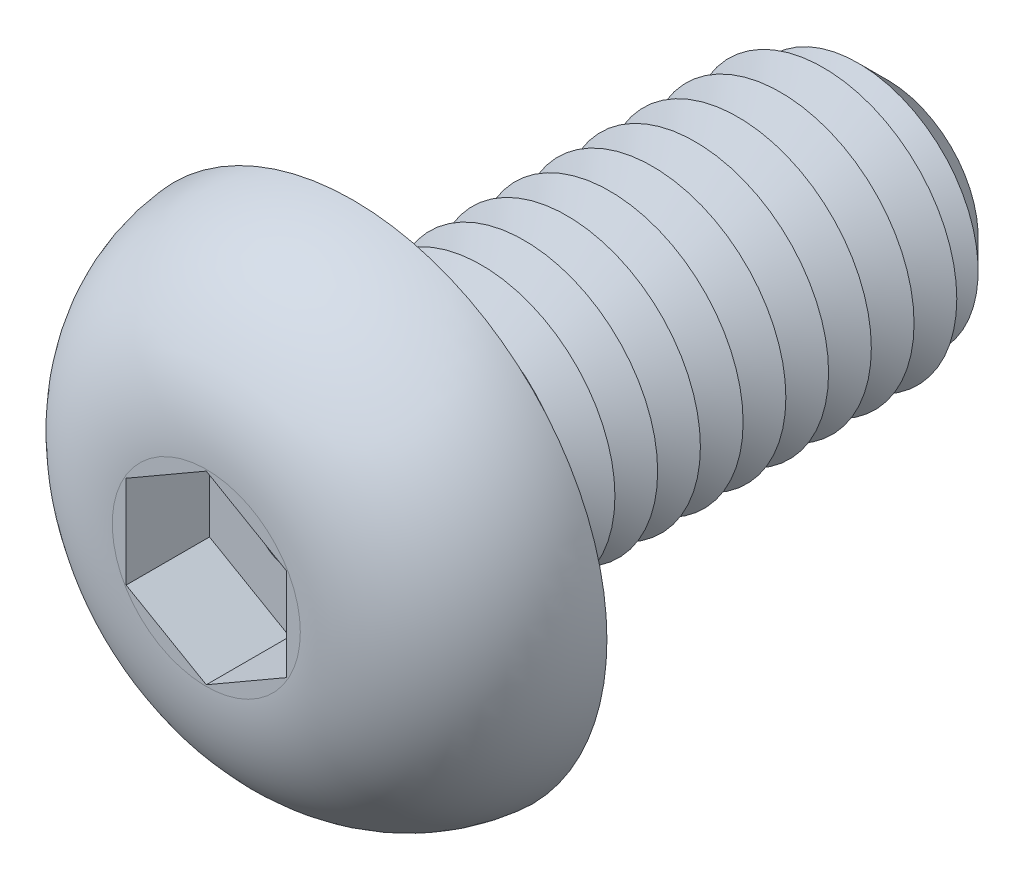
ISO-10303-21;
HEADER;
FILE_DESCRIPTION(('STEP AP214'),'2;1');
FILE_NAME('part.step','',(''),(''),'','','');
FILE_SCHEMA(('AUTOMOTIVE_DESIGN { 1 0 10303 214 1 1 1 1 }'));
ENDSEC;
DATA;
#1=APPLICATION_CONTEXT('core data for automotive mechanical design processes');
#2=APPLICATION_PROTOCOL_DEFINITION('international standard','automotive_design',2000,#1);
#3=PRODUCT_CONTEXT('',#1,'mechanical');
#4=PRODUCT('Part','Part','',(#3));
#5=PRODUCT_RELATED_PRODUCT_CATEGORY('part','',(#4));
#6=PRODUCT_DEFINITION_FORMATION('','',#4);
#7=PRODUCT_DEFINITION_CONTEXT('part definition',#1,'design');
#8=PRODUCT_DEFINITION('design','',#6,#7);
#9=PRODUCT_DEFINITION_SHAPE('','',#8);
#10=(LENGTH_UNIT() NAMED_UNIT(*) SI_UNIT(.MILLI.,.METRE.));
#11=(NAMED_UNIT(*) PLANE_ANGLE_UNIT() SI_UNIT($,.RADIAN.));
#12=(NAMED_UNIT(*) SI_UNIT($,.STERADIAN.) SOLID_ANGLE_UNIT());
#13=UNCERTAINTY_MEASURE_WITH_UNIT(LENGTH_MEASURE(1.E-05),#10,'distance_accuracy_value','');
#14=(GEOMETRIC_REPRESENTATION_CONTEXT(3) GLOBAL_UNCERTAINTY_ASSIGNED_CONTEXT((#13)) GLOBAL_UNIT_ASSIGNED_CONTEXT((#10,
#11,#12)) REPRESENTATION_CONTEXT('',''));
#15=CARTESIAN_POINT('',(0.,0.,0.));
#16=DIRECTION('',(0.,0.,1.));
#17=DIRECTION('',(1.,0.,0.));
#18=AXIS2_PLACEMENT_3D('',#15,#16,#17);
#19=CARTESIAN_POINT('',(0.,0.,-10.));
#20=DIRECTION('',(0.,0.,1.));
#21=DIRECTION('',(1.,0.,0.));
#22=AXIS2_PLACEMENT_3D('',#19,#20,#21);
#23=CYLINDRICAL_SURFACE('',#22,2.5);
#24=CARTESIAN_POINT('',(0.,0.,-0.399999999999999));
#25=DIRECTION('',(0.,0.,1.));
#26=DIRECTION('',(1.,0.,0.));
#27=AXIS2_PLACEMENT_3D('',#24,#25,#26);
#28=CIRCLE('',#27,2.5);
#29=CARTESIAN_POINT('',(2.5,0.,-0.399999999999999));
#30=VERTEX_POINT('',#29);
#31=EDGE_CURVE('E48',#30,#30,#28,.F.);
#32=ORIENTED_EDGE('',*,*,#31,.T.);
#33=EDGE_LOOP('',(#32));
#34=FACE_BOUND('',#33,.T.);
#35=CARTESIAN_POINT('',(0.,0.,-0.800000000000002));
#36=DIRECTION('',(0.,0.,1.));
#37=DIRECTION('',(1.,0.,0.));
#38=AXIS2_PLACEMENT_3D('',#35,#36,#37);
#39=CIRCLE('',#38,2.5);
#40=CARTESIAN_POINT('',(2.5,0.,-0.800000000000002));
#41=VERTEX_POINT('',#40);
#42=EDGE_CURVE('E138',#41,#41,#39,.T.);
#43=ORIENTED_EDGE('',*,*,#42,.T.);
#44=EDGE_LOOP('',(#43));
#45=FACE_BOUND('',#44,.T.);
#46=ADVANCED_FACE('F39',(#34,#45),#23,.T.);
#47=CARTESIAN_POINT('',(0.,4.75,0.));
#48=DIRECTION('',(0.,0.,1.));
#49=DIRECTION('',(1.,0.,0.));
#50=AXIS2_PLACEMENT_3D('',#47,#48,#49);
#51=PLANE('',#50);
#52=CARTESIAN_POINT('',(0.,0.,0.));
#53=DIRECTION('',(0.,0.,1.));
#54=DIRECTION('',(1.,0.,0.));
#55=AXIS2_PLACEMENT_3D('',#52,#53,#54);
#56=CIRCLE('',#55,2.9);
#57=CARTESIAN_POINT('',(2.9,0.,0.));
#58=VERTEX_POINT('',#57);
#59=EDGE_CURVE('E11',#58,#58,#56,.T.);
#60=ORIENTED_EDGE('',*,*,#59,.T.);
#61=EDGE_LOOP('',(#60));
#62=FACE_BOUND('',#61,.T.);
#63=CARTESIAN_POINT('',(0.,0.,0.));
#64=DIRECTION('',(0.,0.,1.));
#65=DIRECTION('',(1.,0.,0.));
#66=AXIS2_PLACEMENT_3D('',#63,#64,#65);
#67=CIRCLE('',#66,4.75);
#68=CARTESIAN_POINT('',(4.75,0.,0.));
#69=VERTEX_POINT('',#68);
#70=EDGE_CURVE('E156',#69,#69,#67,.T.);
#71=ORIENTED_EDGE('',*,*,#70,.F.);
#72=EDGE_LOOP('',(#71));
#73=FACE_BOUND('',#72,.T.);
#74=ADVANCED_FACE('F203',(#62,#73),#51,.F.);
#75=CARTESIAN_POINT('',(0.,0.,2.75));
#76=DIRECTION('',(0.,0.,-1.));
#77=DIRECTION('',(-1.,0.,0.));
#78=AXIS2_PLACEMENT_3D('',#75,#76,#77);
#79=PLANE('',#78);
#80=DIRECTION('',(-0.866025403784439,-0.5,0.));
#81=VECTOR('',#80,1.);
#82=CARTESIAN_POINT('',(0.,1.73205080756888,2.75));
#83=LINE('',#82,#81);
#84=CARTESIAN_POINT('',(0.,1.73205080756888,2.75));
#85=VERTEX_POINT('',#84);
#86=CARTESIAN_POINT('',(-1.5,0.866025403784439,2.75));
#87=VERTEX_POINT('',#86);
#88=EDGE_CURVE('E137',#85,#87,#83,.T.);
#89=ORIENTED_EDGE('',*,*,#88,.F.);
#90=DIRECTION('',(-0.866025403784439,0.5,0.));
#91=VECTOR('',#90,1.);
#92=CARTESIAN_POINT('',(1.5,0.86602540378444,2.75));
#93=LINE('',#92,#91);
#94=CARTESIAN_POINT('',(1.5,0.86602540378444,2.75));
#95=VERTEX_POINT('',#94);
#96=EDGE_CURVE('E55',#95,#85,#93,.T.);
#97=ORIENTED_EDGE('',*,*,#96,.F.);
#98=DIRECTION('',(0.,1.,0.));
#99=VECTOR('',#98,1.);
#100=CARTESIAN_POINT('',(1.5,-0.866025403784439,2.75));
#101=LINE('',#100,#99);
#102=CARTESIAN_POINT('',(1.5,-0.866025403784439,2.75));
#103=VERTEX_POINT('',#102);
#104=EDGE_CURVE('E150',#103,#95,#101,.T.);
#105=ORIENTED_EDGE('',*,*,#104,.F.);
#106=DIRECTION('',(0.866025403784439,0.5,0.));
#107=VECTOR('',#106,1.);
#108=CARTESIAN_POINT('',(0.,-1.73205080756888,2.75));
#109=LINE('',#108,#107);
#110=CARTESIAN_POINT('',(0.,-1.73205080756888,2.75));
#111=VERTEX_POINT('',#110);
#112=EDGE_CURVE('E147',#111,#103,#109,.T.);
#113=ORIENTED_EDGE('',*,*,#112,.F.);
#114=DIRECTION('',(0.866025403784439,-0.5,0.));
#115=VECTOR('',#114,1.);
#116=CARTESIAN_POINT('',(-1.5,-0.866025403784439,2.75));
#117=LINE('',#116,#115);
#118=CARTESIAN_POINT('',(-1.5,-0.866025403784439,2.75));
#119=VERTEX_POINT('',#118);
#120=EDGE_CURVE('E103',#119,#111,#117,.T.);
#121=ORIENTED_EDGE('',*,*,#120,.F.);
#122=DIRECTION('',(0.,-1.,0.));
#123=VECTOR('',#122,1.);
#124=CARTESIAN_POINT('',(-1.5,0.866025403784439,2.75));
#125=LINE('',#124,#123);
#126=EDGE_CURVE('E141',#87,#119,#125,.T.);
#127=ORIENTED_EDGE('',*,*,#126,.F.);
#128=EDGE_LOOP('',(#89,#97,#105,#113,#121,#127));
#129=FACE_BOUND('',#128,.T.);
#130=CARTESIAN_POINT('',(0.,0.,2.75));
#131=DIRECTION('',(0.,0.,1.));
#132=DIRECTION('',(1.,0.,0.));
#133=AXIS2_PLACEMENT_3D('',#130,#131,#132);
#134=CIRCLE('',#133,1.76043481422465);
#135=CARTESIAN_POINT('',(1.76043481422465,0.,2.75));
#136=VERTEX_POINT('',#135);
#137=EDGE_CURVE('E169',#136,#136,#134,.T.);
#138=ORIENTED_EDGE('',*,*,#137,.T.);
#139=EDGE_LOOP('',(#138));
#140=FACE_BOUND('',#139,.T.);
#141=ADVANCED_FACE('F208',(#129,#140),#79,.F.);
#142=CARTESIAN_POINT('',(0.,0.,-0.25));
#143=DIRECTION('',(0.,0.,1.));
#144=DIRECTION('',(1.,0.,0.));
#145=AXIS2_PLACEMENT_3D('',#142,#143,#144);
#146=DEGENERATE_TOROIDAL_SURFACE('',#145,1.76043481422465,3.,.T.);
#147=ORIENTED_EDGE('',*,*,#137,.F.);
#148=EDGE_LOOP('',(#147));
#149=FACE_BOUND('',#148,.T.);
#150=ORIENTED_EDGE('',*,*,#70,.T.);
#151=EDGE_LOOP('',(#150));
#152=FACE_BOUND('',#151,.T.);
#153=ADVANCED_FACE('F236',(#149,#152),#146,.T.);
#154=CARTESIAN_POINT('',(1.5,0.86602540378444,1.19));
#155=DIRECTION('',(0.5,0.866025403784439,0.));
#156=DIRECTION('',(-0.866025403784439,0.5,0.));
#157=AXIS2_PLACEMENT_3D('',#154,#155,#156);
#158=PLANE('',#157);
#159=ORIENTED_EDGE('',*,*,#96,.T.);
#160=DIRECTION('',(0.,0.,1.));
#161=VECTOR('',#160,1.);
#162=CARTESIAN_POINT('',(0.,1.73205080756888,1.19));
#163=LINE('',#162,#161);
#164=CARTESIAN_POINT('',(0.,1.73205080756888,1.19));
#165=VERTEX_POINT('',#164);
#166=EDGE_CURVE('E85',#165,#85,#163,.T.);
#167=ORIENTED_EDGE('',*,*,#166,.F.);
#168=DIRECTION('',(-0.866025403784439,0.5,0.));
#169=VECTOR('',#168,1.);
#170=CARTESIAN_POINT('',(1.5,0.86602540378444,1.19));
#171=LINE('',#170,#169);
#172=CARTESIAN_POINT('',(1.5,0.86602540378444,1.19));
#173=VERTEX_POINT('',#172);
#174=EDGE_CURVE('E153',#173,#165,#171,.T.);
#175=ORIENTED_EDGE('',*,*,#174,.F.);
#176=DIRECTION('',(0.,0.,1.));
#177=VECTOR('',#176,1.);
#178=CARTESIAN_POINT('',(1.5,0.86602540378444,1.19));
#179=LINE('',#178,#177);
#180=EDGE_CURVE('E63',#173,#95,#179,.T.);
#181=ORIENTED_EDGE('',*,*,#180,.T.);
#182=EDGE_LOOP('',(#159,#167,#175,#181));
#183=FACE_BOUND('',#182,.T.);
#184=ADVANCED_FACE('F222',(#183),#158,.F.);
#185=CARTESIAN_POINT('',(1.5,-0.866025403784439,1.19));
#186=DIRECTION('',(1.,0.,0.));
#187=DIRECTION('',(0.,1.,0.));
#188=AXIS2_PLACEMENT_3D('',#185,#186,#187);
#189=PLANE('',#188);
#190=ORIENTED_EDGE('',*,*,#104,.T.);
#191=ORIENTED_EDGE('',*,*,#180,.F.);
#192=DIRECTION('',(0.,1.,0.));
#193=VECTOR('',#192,1.);
#194=CARTESIAN_POINT('',(1.5,-0.866025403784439,1.19));
#195=LINE('',#194,#193);
#196=CARTESIAN_POINT('',(1.5,-0.866025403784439,1.19));
#197=VERTEX_POINT('',#196);
#198=EDGE_CURVE('E117',#197,#173,#195,.T.);
#199=ORIENTED_EDGE('',*,*,#198,.F.);
#200=DIRECTION('',(0.,0.,1.));
#201=VECTOR('',#200,1.);
#202=CARTESIAN_POINT('',(1.5,-0.866025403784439,1.19));
#203=LINE('',#202,#201);
#204=EDGE_CURVE('E108',#197,#103,#203,.T.);
#205=ORIENTED_EDGE('',*,*,#204,.T.);
#206=EDGE_LOOP('',(#190,#191,#199,#205));
#207=FACE_BOUND('',#206,.T.);
#208=ADVANCED_FACE('F219',(#207),#189,.F.);
#209=CARTESIAN_POINT('',(0.,-1.73205080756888,1.19));
#210=DIRECTION('',(0.5,-0.866025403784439,0.));
#211=DIRECTION('',(0.866025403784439,0.5,0.));
#212=AXIS2_PLACEMENT_3D('',#209,#210,#211);
#213=PLANE('',#212);
#214=ORIENTED_EDGE('',*,*,#112,.T.);
#215=ORIENTED_EDGE('',*,*,#204,.F.);
#216=DIRECTION('',(0.866025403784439,0.5,0.));
#217=VECTOR('',#216,1.);
#218=CARTESIAN_POINT('',(0.,-1.73205080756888,1.19));
#219=LINE('',#218,#217);
#220=CARTESIAN_POINT('',(0.,-1.73205080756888,1.19));
#221=VERTEX_POINT('',#220);
#222=EDGE_CURVE('E112',#221,#197,#219,.T.);
#223=ORIENTED_EDGE('',*,*,#222,.F.);
#224=DIRECTION('',(0.,0.,1.));
#225=VECTOR('',#224,1.);
#226=CARTESIAN_POINT('',(0.,-1.73205080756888,1.19));
#227=LINE('',#226,#225);
#228=EDGE_CURVE('E96',#221,#111,#227,.T.);
#229=ORIENTED_EDGE('',*,*,#228,.T.);
#230=EDGE_LOOP('',(#214,#215,#223,#229));
#231=FACE_BOUND('',#230,.T.);
#232=ADVANCED_FACE('F113',(#231),#213,.F.);
#233=CARTESIAN_POINT('',(-1.5,-0.866025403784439,1.19));
#234=DIRECTION('',(-0.5,-0.866025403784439,0.));
#235=DIRECTION('',(0.866025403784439,-0.5,0.));
#236=AXIS2_PLACEMENT_3D('',#233,#234,#235);
#237=PLANE('',#236);
#238=ORIENTED_EDGE('',*,*,#120,.T.);
#239=ORIENTED_EDGE('',*,*,#228,.F.);
#240=DIRECTION('',(0.866025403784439,-0.5,0.));
#241=VECTOR('',#240,1.);
#242=CARTESIAN_POINT('',(-1.5,-0.866025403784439,1.19));
#243=LINE('',#242,#241);
#244=CARTESIAN_POINT('',(-1.5,-0.866025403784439,1.19));
#245=VERTEX_POINT('',#244);
#246=EDGE_CURVE('E100',#245,#221,#243,.T.);
#247=ORIENTED_EDGE('',*,*,#246,.F.);
#248=DIRECTION('',(0.,0.,1.));
#249=VECTOR('',#248,1.);
#250=CARTESIAN_POINT('',(-1.5,-0.866025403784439,1.19));
#251=LINE('',#250,#249);
#252=EDGE_CURVE('E109',#245,#119,#251,.T.);
#253=ORIENTED_EDGE('',*,*,#252,.T.);
#254=EDGE_LOOP('',(#238,#239,#247,#253));
#255=FACE_BOUND('',#254,.T.);
#256=ADVANCED_FACE('F98',(#255),#237,.F.);
#257=CARTESIAN_POINT('',(-1.5,0.866025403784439,1.19));
#258=DIRECTION('',(-1.,0.,0.));
#259=DIRECTION('',(0.,-1.,0.));
#260=AXIS2_PLACEMENT_3D('',#257,#258,#259);
#261=PLANE('',#260);
#262=ORIENTED_EDGE('',*,*,#126,.T.);
#263=ORIENTED_EDGE('',*,*,#252,.F.);
#264=DIRECTION('',(0.,-1.,0.));
#265=VECTOR('',#264,1.);
#266=CARTESIAN_POINT('',(-1.5,0.866025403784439,1.19));
#267=LINE('',#266,#265);
#268=CARTESIAN_POINT('',(-1.5,0.866025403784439,1.19));
#269=VERTEX_POINT('',#268);
#270=EDGE_CURVE('E123',#269,#245,#267,.T.);
#271=ORIENTED_EDGE('',*,*,#270,.F.);
#272=DIRECTION('',(0.,0.,1.));
#273=VECTOR('',#272,1.);
#274=CARTESIAN_POINT('',(-1.5,0.866025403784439,1.19));
#275=LINE('',#274,#273);
#276=EDGE_CURVE('E161',#269,#87,#275,.T.);
#277=ORIENTED_EDGE('',*,*,#276,.T.);
#278=EDGE_LOOP('',(#262,#263,#271,#277));
#279=FACE_BOUND('',#278,.T.);
#280=ADVANCED_FACE('F227',(#279),#261,.F.);
#281=CARTESIAN_POINT('',(0.,1.73205080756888,1.19));
#282=DIRECTION('',(-0.5,0.866025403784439,0.));
#283=DIRECTION('',(-0.866025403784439,-0.5,0.));
#284=AXIS2_PLACEMENT_3D('',#281,#282,#283);
#285=PLANE('',#284);
#286=ORIENTED_EDGE('',*,*,#88,.T.);
#287=ORIENTED_EDGE('',*,*,#276,.F.);
#288=DIRECTION('',(-0.866025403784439,-0.5,0.));
#289=VECTOR('',#288,1.);
#290=CARTESIAN_POINT('',(0.,1.73205080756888,1.19));
#291=LINE('',#290,#289);
#292=EDGE_CURVE('E129',#165,#269,#291,.T.);
#293=ORIENTED_EDGE('',*,*,#292,.F.);
#294=ORIENTED_EDGE('',*,*,#166,.T.);
#295=EDGE_LOOP('',(#286,#287,#293,#294));
#296=FACE_BOUND('',#295,.T.);
#297=ADVANCED_FACE('F217',(#296),#285,.F.);
#298=CARTESIAN_POINT('',(0.,0.,1.19));
#299=DIRECTION('',(0.,0.,1.));
#300=DIRECTION('',(1.,0.,0.));
#301=AXIS2_PLACEMENT_3D('',#298,#299,#300);
#302=PLANE('',#301);
#303=CARTESIAN_POINT('',(0.,0.,1.19));
#304=DIRECTION('',(0.,0.,1.));
#305=DIRECTION('',(1.,0.,0.));
#306=AXIS2_PLACEMENT_3D('',#303,#304,#305);
#307=CIRCLE('',#306,0.65);
#308=CARTESIAN_POINT('',(0.65,0.,1.19));
#309=VERTEX_POINT('',#308);
#310=EDGE_CURVE('E343',#309,#309,#307,.T.);
#311=ORIENTED_EDGE('',*,*,#310,.F.);
#312=EDGE_LOOP('',(#311));
#313=FACE_BOUND('',#312,.T.);
#314=ORIENTED_EDGE('',*,*,#174,.T.);
#315=ORIENTED_EDGE('',*,*,#292,.T.);
#316=ORIENTED_EDGE('',*,*,#270,.T.);
#317=ORIENTED_EDGE('',*,*,#246,.T.);
#318=ORIENTED_EDGE('',*,*,#222,.T.);
#319=ORIENTED_EDGE('',*,*,#198,.T.);
#320=EDGE_LOOP('',(#314,#315,#316,#317,#318,#319));
#321=FACE_BOUND('',#320,.T.);
#322=ADVANCED_FACE('F120',(#313,#321),#302,.T.);
#323=CARTESIAN_POINT('',(0.,0.,-0.800000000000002));
#324=DIRECTION('',(0.,0.,1.));
#325=DIRECTION('',(1.,0.,0.));
#326=AXIS2_PLACEMENT_3D('',#323,#324,#325);
#327=CONICAL_SURFACE('',#326,2.5,1.0471975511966);
#328=CARTESIAN_POINT('',(0.,0.,-1.2));
#329=DIRECTION('',(0.,0.,1.));
#330=DIRECTION('',(1.,0.,0.));
#331=AXIS2_PLACEMENT_3D('',#328,#329,#330);
#332=CIRCLE('',#331,1.80717967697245);
#333=CARTESIAN_POINT('',(1.80717967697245,0.,-1.2));
#334=VERTEX_POINT('',#333);
#335=EDGE_CURVE('E260',#334,#334,#332,.T.);
#336=ORIENTED_EDGE('',*,*,#335,.T.);
#337=EDGE_LOOP('',(#336));
#338=FACE_BOUND('',#337,.T.);
#339=ORIENTED_EDGE('',*,*,#42,.F.);
#340=EDGE_LOOP('',(#339));
#341=FACE_BOUND('',#340,.T.);
#342=ADVANCED_FACE('F216',(#338,#341),#327,.T.);
#343=CARTESIAN_POINT('',(0.,0.,-1.2));
#344=DIRECTION('',(0.,0.,-1.));
#345=DIRECTION('',(-1.,0.,0.));
#346=AXIS2_PLACEMENT_3D('',#343,#344,#345);
#347=CONICAL_SURFACE('',#346,1.80717967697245,1.0471975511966);
#348=CARTESIAN_POINT('',(0.,0.,-1.6));
#349=DIRECTION('',(0.,0.,1.));
#350=DIRECTION('',(1.,0.,0.));
#351=AXIS2_PLACEMENT_3D('',#348,#349,#350);
#352=CIRCLE('',#351,2.5);
#353=CARTESIAN_POINT('',(2.5,0.,-1.6));
#354=VERTEX_POINT('',#353);
#355=EDGE_CURVE('E264',#354,#354,#352,.T.);
#356=ORIENTED_EDGE('',*,*,#355,.T.);
#357=EDGE_LOOP('',(#356));
#358=FACE_BOUND('',#357,.T.);
#359=ORIENTED_EDGE('',*,*,#335,.F.);
#360=EDGE_LOOP('',(#359));
#361=FACE_BOUND('',#360,.T.);
#362=ADVANCED_FACE('F473',(#358,#361),#347,.T.);
#363=CARTESIAN_POINT('',(0.,0.,-1.6));
#364=DIRECTION('',(0.,0.,1.));
#365=DIRECTION('',(1.,0.,0.));
#366=AXIS2_PLACEMENT_3D('',#363,#364,#365);
#367=CONICAL_SURFACE('',#366,2.5,1.0471975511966);
#368=CARTESIAN_POINT('',(0.,0.,-2.));
#369=DIRECTION('',(0.,0.,1.));
#370=DIRECTION('',(1.,0.,0.));
#371=AXIS2_PLACEMENT_3D('',#368,#369,#370);
#372=CIRCLE('',#371,1.80717967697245);
#373=CARTESIAN_POINT('',(1.80717967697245,0.,-2.));
#374=VERTEX_POINT('',#373);
#375=EDGE_CURVE('E268',#374,#374,#372,.T.);
#376=ORIENTED_EDGE('',*,*,#375,.T.);
#377=EDGE_LOOP('',(#376));
#378=FACE_BOUND('',#377,.T.);
#379=ORIENTED_EDGE('',*,*,#355,.F.);
#380=EDGE_LOOP('',(#379));
#381=FACE_BOUND('',#380,.T.);
#382=ADVANCED_FACE('F467',(#378,#381),#367,.T.);
#383=CARTESIAN_POINT('',(0.,0.,-2.));
#384=DIRECTION('',(0.,0.,-1.));
#385=DIRECTION('',(-1.,0.,0.));
#386=AXIS2_PLACEMENT_3D('',#383,#384,#385);
#387=CONICAL_SURFACE('',#386,1.80717967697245,1.0471975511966);
#388=CARTESIAN_POINT('',(0.,0.,-2.4));
#389=DIRECTION('',(0.,0.,1.));
#390=DIRECTION('',(1.,0.,0.));
#391=AXIS2_PLACEMENT_3D('',#388,#389,#390);
#392=CIRCLE('',#391,2.5);
#393=CARTESIAN_POINT('',(2.5,0.,-2.4));
#394=VERTEX_POINT('',#393);
#395=EDGE_CURVE('E272',#394,#394,#392,.T.);
#396=ORIENTED_EDGE('',*,*,#395,.T.);
#397=EDGE_LOOP('',(#396));
#398=FACE_BOUND('',#397,.T.);
#399=ORIENTED_EDGE('',*,*,#375,.F.);
#400=EDGE_LOOP('',(#399));
#401=FACE_BOUND('',#400,.T.);
#402=ADVANCED_FACE('F461',(#398,#401),#387,.T.);
#403=CARTESIAN_POINT('',(0.,0.,-2.4));
#404=DIRECTION('',(0.,0.,1.));
#405=DIRECTION('',(1.,0.,0.));
#406=AXIS2_PLACEMENT_3D('',#403,#404,#405);
#407=CONICAL_SURFACE('',#406,2.5,1.0471975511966);
#408=CARTESIAN_POINT('',(0.,0.,-2.8));
#409=DIRECTION('',(0.,0.,1.));
#410=DIRECTION('',(1.,0.,0.));
#411=AXIS2_PLACEMENT_3D('',#408,#409,#410);
#412=CIRCLE('',#411,1.80717967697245);
#413=CARTESIAN_POINT('',(1.80717967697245,0.,-2.8));
#414=VERTEX_POINT('',#413);
#415=EDGE_CURVE('E276',#414,#414,#412,.T.);
#416=ORIENTED_EDGE('',*,*,#415,.T.);
#417=EDGE_LOOP('',(#416));
#418=FACE_BOUND('',#417,.T.);
#419=ORIENTED_EDGE('',*,*,#395,.F.);
#420=EDGE_LOOP('',(#419));
#421=FACE_BOUND('',#420,.T.);
#422=ADVANCED_FACE('F455',(#418,#421),#407,.T.);
#423=CARTESIAN_POINT('',(0.,0.,-2.8));
#424=DIRECTION('',(0.,0.,-1.));
#425=DIRECTION('',(-1.,0.,0.));
#426=AXIS2_PLACEMENT_3D('',#423,#424,#425);
#427=CONICAL_SURFACE('',#426,1.80717967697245,1.0471975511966);
#428=CARTESIAN_POINT('',(0.,0.,-3.2));
#429=DIRECTION('',(0.,0.,1.));
#430=DIRECTION('',(1.,0.,0.));
#431=AXIS2_PLACEMENT_3D('',#428,#429,#430);
#432=CIRCLE('',#431,2.5);
#433=CARTESIAN_POINT('',(2.5,0.,-3.2));
#434=VERTEX_POINT('',#433);
#435=EDGE_CURVE('E280',#434,#434,#432,.T.);
#436=ORIENTED_EDGE('',*,*,#435,.T.);
#437=EDGE_LOOP('',(#436));
#438=FACE_BOUND('',#437,.T.);
#439=ORIENTED_EDGE('',*,*,#415,.F.);
#440=EDGE_LOOP('',(#439));
#441=FACE_BOUND('',#440,.T.);
#442=ADVANCED_FACE('F449',(#438,#441),#427,.T.);
#443=CARTESIAN_POINT('',(0.,0.,-3.2));
#444=DIRECTION('',(0.,0.,1.));
#445=DIRECTION('',(1.,0.,0.));
#446=AXIS2_PLACEMENT_3D('',#443,#444,#445);
#447=CONICAL_SURFACE('',#446,2.5,1.0471975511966);
#448=CARTESIAN_POINT('',(0.,0.,-3.6));
#449=DIRECTION('',(0.,0.,1.));
#450=DIRECTION('',(1.,0.,0.));
#451=AXIS2_PLACEMENT_3D('',#448,#449,#450);
#452=CIRCLE('',#451,1.80717967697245);
#453=CARTESIAN_POINT('',(1.80717967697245,0.,-3.6));
#454=VERTEX_POINT('',#453);
#455=EDGE_CURVE('E283',#454,#454,#452,.T.);
#456=ORIENTED_EDGE('',*,*,#455,.T.);
#457=EDGE_LOOP('',(#456));
#458=FACE_BOUND('',#457,.T.);
#459=ORIENTED_EDGE('',*,*,#435,.F.);
#460=EDGE_LOOP('',(#459));
#461=FACE_BOUND('',#460,.T.);
#462=ADVANCED_FACE('F443',(#458,#461),#447,.T.);
#463=CARTESIAN_POINT('',(0.,0.,-3.6));
#464=DIRECTION('',(0.,0.,-1.));
#465=DIRECTION('',(-1.,0.,0.));
#466=AXIS2_PLACEMENT_3D('',#463,#464,#465);
#467=CONICAL_SURFACE('',#466,1.80717967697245,1.0471975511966);
#468=CARTESIAN_POINT('',(0.,0.,-4.));
#469=DIRECTION('',(0.,0.,1.));
#470=DIRECTION('',(1.,0.,0.));
#471=AXIS2_PLACEMENT_3D('',#468,#469,#470);
#472=CIRCLE('',#471,2.5);
#473=CARTESIAN_POINT('',(2.5,0.,-4.));
#474=VERTEX_POINT('',#473);
#475=EDGE_CURVE('E287',#474,#474,#472,.T.);
#476=ORIENTED_EDGE('',*,*,#475,.T.);
#477=EDGE_LOOP('',(#476));
#478=FACE_BOUND('',#477,.T.);
#479=ORIENTED_EDGE('',*,*,#455,.F.);
#480=EDGE_LOOP('',(#479));
#481=FACE_BOUND('',#480,.T.);
#482=ADVANCED_FACE('F437',(#478,#481),#467,.T.);
#483=CARTESIAN_POINT('',(0.,0.,-4.));
#484=DIRECTION('',(0.,0.,1.));
#485=DIRECTION('',(1.,0.,0.));
#486=AXIS2_PLACEMENT_3D('',#483,#484,#485);
#487=CONICAL_SURFACE('',#486,2.5,1.0471975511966);
#488=CARTESIAN_POINT('',(0.,0.,-4.4));
#489=DIRECTION('',(0.,0.,1.));
#490=DIRECTION('',(1.,0.,0.));
#491=AXIS2_PLACEMENT_3D('',#488,#489,#490);
#492=CIRCLE('',#491,1.80717967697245);
#493=CARTESIAN_POINT('',(1.80717967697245,0.,-4.4));
#494=VERTEX_POINT('',#493);
#495=EDGE_CURVE('E291',#494,#494,#492,.T.);
#496=ORIENTED_EDGE('',*,*,#495,.T.);
#497=EDGE_LOOP('',(#496));
#498=FACE_BOUND('',#497,.T.);
#499=ORIENTED_EDGE('',*,*,#475,.F.);
#500=EDGE_LOOP('',(#499));
#501=FACE_BOUND('',#500,.T.);
#502=ADVANCED_FACE('F431',(#498,#501),#487,.T.);
#503=CARTESIAN_POINT('',(0.,0.,-4.4));
#504=DIRECTION('',(0.,0.,-1.));
#505=DIRECTION('',(-1.,0.,0.));
#506=AXIS2_PLACEMENT_3D('',#503,#504,#505);
#507=CONICAL_SURFACE('',#506,1.80717967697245,1.0471975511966);
#508=CARTESIAN_POINT('',(0.,0.,-4.8));
#509=DIRECTION('',(0.,0.,1.));
#510=DIRECTION('',(1.,0.,0.));
#511=AXIS2_PLACEMENT_3D('',#508,#509,#510);
#512=CIRCLE('',#511,2.5);
#513=CARTESIAN_POINT('',(2.5,0.,-4.8));
#514=VERTEX_POINT('',#513);
#515=EDGE_CURVE('E295',#514,#514,#512,.T.);
#516=ORIENTED_EDGE('',*,*,#515,.T.);
#517=EDGE_LOOP('',(#516));
#518=FACE_BOUND('',#517,.T.);
#519=ORIENTED_EDGE('',*,*,#495,.F.);
#520=EDGE_LOOP('',(#519));
#521=FACE_BOUND('',#520,.T.);
#522=ADVANCED_FACE('F425',(#518,#521),#507,.T.);
#523=CARTESIAN_POINT('',(0.,0.,-4.8));
#524=DIRECTION('',(0.,0.,1.));
#525=DIRECTION('',(1.,0.,0.));
#526=AXIS2_PLACEMENT_3D('',#523,#524,#525);
#527=CONICAL_SURFACE('',#526,2.5,1.0471975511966);
#528=CARTESIAN_POINT('',(0.,0.,-5.2));
#529=DIRECTION('',(0.,0.,1.));
#530=DIRECTION('',(1.,0.,0.));
#531=AXIS2_PLACEMENT_3D('',#528,#529,#530);
#532=CIRCLE('',#531,1.80717967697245);
#533=CARTESIAN_POINT('',(1.80717967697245,0.,-5.2));
#534=VERTEX_POINT('',#533);
#535=EDGE_CURVE('E299',#534,#534,#532,.T.);
#536=ORIENTED_EDGE('',*,*,#535,.T.);
#537=EDGE_LOOP('',(#536));
#538=FACE_BOUND('',#537,.T.);
#539=ORIENTED_EDGE('',*,*,#515,.F.);
#540=EDGE_LOOP('',(#539));
#541=FACE_BOUND('',#540,.T.);
#542=ADVANCED_FACE('F419',(#538,#541),#527,.T.);
#543=CARTESIAN_POINT('',(0.,0.,-5.2));
#544=DIRECTION('',(0.,0.,-1.));
#545=DIRECTION('',(-1.,0.,0.));
#546=AXIS2_PLACEMENT_3D('',#543,#544,#545);
#547=CONICAL_SURFACE('',#546,1.80717967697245,1.0471975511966);
#548=CARTESIAN_POINT('',(0.,0.,-5.6));
#549=DIRECTION('',(0.,0.,1.));
#550=DIRECTION('',(1.,0.,0.));
#551=AXIS2_PLACEMENT_3D('',#548,#549,#550);
#552=CIRCLE('',#551,2.5);
#553=CARTESIAN_POINT('',(2.5,0.,-5.6));
#554=VERTEX_POINT('',#553);
#555=EDGE_CURVE('E303',#554,#554,#552,.T.);
#556=ORIENTED_EDGE('',*,*,#555,.T.);
#557=EDGE_LOOP('',(#556));
#558=FACE_BOUND('',#557,.T.);
#559=ORIENTED_EDGE('',*,*,#535,.F.);
#560=EDGE_LOOP('',(#559));
#561=FACE_BOUND('',#560,.T.);
#562=ADVANCED_FACE('F413',(#558,#561),#547,.T.);
#563=CARTESIAN_POINT('',(0.,0.,-5.6));
#564=DIRECTION('',(0.,0.,1.));
#565=DIRECTION('',(1.,0.,0.));
#566=AXIS2_PLACEMENT_3D('',#563,#564,#565);
#567=CONICAL_SURFACE('',#566,2.5,1.0471975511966);
#568=CARTESIAN_POINT('',(0.,0.,-6.));
#569=DIRECTION('',(0.,0.,1.));
#570=DIRECTION('',(1.,0.,0.));
#571=AXIS2_PLACEMENT_3D('',#568,#569,#570);
#572=CIRCLE('',#571,1.80717967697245);
#573=CARTESIAN_POINT('',(1.80717967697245,0.,-6.));
#574=VERTEX_POINT('',#573);
#575=EDGE_CURVE('E307',#574,#574,#572,.T.);
#576=ORIENTED_EDGE('',*,*,#575,.T.);
#577=EDGE_LOOP('',(#576));
#578=FACE_BOUND('',#577,.T.);
#579=ORIENTED_EDGE('',*,*,#555,.F.);
#580=EDGE_LOOP('',(#579));
#581=FACE_BOUND('',#580,.T.);
#582=ADVANCED_FACE('F407',(#578,#581),#567,.T.);
#583=CARTESIAN_POINT('',(0.,0.,-6.));
#584=DIRECTION('',(0.,0.,-1.));
#585=DIRECTION('',(-1.,0.,0.));
#586=AXIS2_PLACEMENT_3D('',#583,#584,#585);
#587=CONICAL_SURFACE('',#586,1.80717967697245,1.0471975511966);
#588=CARTESIAN_POINT('',(0.,0.,-6.4));
#589=DIRECTION('',(0.,0.,1.));
#590=DIRECTION('',(1.,0.,0.));
#591=AXIS2_PLACEMENT_3D('',#588,#589,#590);
#592=CIRCLE('',#591,2.5);
#593=CARTESIAN_POINT('',(2.5,0.,-6.4));
#594=VERTEX_POINT('',#593);
#595=EDGE_CURVE('E311',#594,#594,#592,.T.);
#596=ORIENTED_EDGE('',*,*,#595,.T.);
#597=EDGE_LOOP('',(#596));
#598=FACE_BOUND('',#597,.T.);
#599=ORIENTED_EDGE('',*,*,#575,.F.);
#600=EDGE_LOOP('',(#599));
#601=FACE_BOUND('',#600,.T.);
#602=ADVANCED_FACE('F401',(#598,#601),#587,.T.);
#603=CARTESIAN_POINT('',(0.,0.,-6.4));
#604=DIRECTION('',(0.,0.,1.));
#605=DIRECTION('',(1.,0.,0.));
#606=AXIS2_PLACEMENT_3D('',#603,#604,#605);
#607=CONICAL_SURFACE('',#606,2.5,1.0471975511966);
#608=CARTESIAN_POINT('',(0.,0.,-6.8));
#609=DIRECTION('',(0.,0.,1.));
#610=DIRECTION('',(1.,0.,0.));
#611=AXIS2_PLACEMENT_3D('',#608,#609,#610);
#612=CIRCLE('',#611,1.80717967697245);
#613=CARTESIAN_POINT('',(1.80717967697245,0.,-6.8));
#614=VERTEX_POINT('',#613);
#615=EDGE_CURVE('E315',#614,#614,#612,.T.);
#616=ORIENTED_EDGE('',*,*,#615,.T.);
#617=EDGE_LOOP('',(#616));
#618=FACE_BOUND('',#617,.T.);
#619=ORIENTED_EDGE('',*,*,#595,.F.);
#620=EDGE_LOOP('',(#619));
#621=FACE_BOUND('',#620,.T.);
#622=ADVANCED_FACE('F395',(#618,#621),#607,.T.);
#623=CARTESIAN_POINT('',(0.,0.,-6.8));
#624=DIRECTION('',(0.,0.,-1.));
#625=DIRECTION('',(-1.,0.,0.));
#626=AXIS2_PLACEMENT_3D('',#623,#624,#625);
#627=CONICAL_SURFACE('',#626,1.80717967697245,1.0471975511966);
#628=CARTESIAN_POINT('',(0.,0.,-7.2));
#629=DIRECTION('',(0.,0.,1.));
#630=DIRECTION('',(1.,0.,0.));
#631=AXIS2_PLACEMENT_3D('',#628,#629,#630);
#632=CIRCLE('',#631,2.5);
#633=CARTESIAN_POINT('',(2.5,0.,-7.2));
#634=VERTEX_POINT('',#633);
#635=EDGE_CURVE('E318',#634,#634,#632,.T.);
#636=ORIENTED_EDGE('',*,*,#635,.T.);
#637=EDGE_LOOP('',(#636));
#638=FACE_BOUND('',#637,.T.);
#639=ORIENTED_EDGE('',*,*,#615,.F.);
#640=EDGE_LOOP('',(#639));
#641=FACE_BOUND('',#640,.T.);
#642=ADVANCED_FACE('F389',(#638,#641),#627,.T.);
#643=CARTESIAN_POINT('',(0.,0.,-7.2));
#644=DIRECTION('',(0.,0.,1.));
#645=DIRECTION('',(1.,0.,0.));
#646=AXIS2_PLACEMENT_3D('',#643,#644,#645);
#647=CONICAL_SURFACE('',#646,2.5,1.0471975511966);
#648=CARTESIAN_POINT('',(0.,0.,-7.6));
#649=DIRECTION('',(0.,0.,1.));
#650=DIRECTION('',(1.,0.,0.));
#651=AXIS2_PLACEMENT_3D('',#648,#649,#650);
#652=CIRCLE('',#651,1.80717967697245);
#653=CARTESIAN_POINT('',(1.80717967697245,0.,-7.6));
#654=VERTEX_POINT('',#653);
#655=EDGE_CURVE('E322',#654,#654,#652,.T.);
#656=ORIENTED_EDGE('',*,*,#655,.T.);
#657=EDGE_LOOP('',(#656));
#658=FACE_BOUND('',#657,.T.);
#659=ORIENTED_EDGE('',*,*,#635,.F.);
#660=EDGE_LOOP('',(#659));
#661=FACE_BOUND('',#660,.T.);
#662=ADVANCED_FACE('F383',(#658,#661),#647,.T.);
#663=CARTESIAN_POINT('',(0.,0.,-7.6));
#664=DIRECTION('',(0.,0.,-1.));
#665=DIRECTION('',(-1.,0.,0.));
#666=AXIS2_PLACEMENT_3D('',#663,#664,#665);
#667=CONICAL_SURFACE('',#666,1.80717967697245,1.0471975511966);
#668=CARTESIAN_POINT('',(0.,0.,-8.));
#669=DIRECTION('',(0.,0.,1.));
#670=DIRECTION('',(1.,0.,0.));
#671=AXIS2_PLACEMENT_3D('',#668,#669,#670);
#672=CIRCLE('',#671,2.5);
#673=CARTESIAN_POINT('',(2.5,0.,-8.));
#674=VERTEX_POINT('',#673);
#675=EDGE_CURVE('E326',#674,#674,#672,.T.);
#676=ORIENTED_EDGE('',*,*,#675,.T.);
#677=EDGE_LOOP('',(#676));
#678=FACE_BOUND('',#677,.T.);
#679=ORIENTED_EDGE('',*,*,#655,.F.);
#680=EDGE_LOOP('',(#679));
#681=FACE_BOUND('',#680,.T.);
#682=ADVANCED_FACE('F377',(#678,#681),#667,.T.);
#683=CARTESIAN_POINT('',(0.,0.,-8.));
#684=DIRECTION('',(0.,0.,1.));
#685=DIRECTION('',(1.,0.,0.));
#686=AXIS2_PLACEMENT_3D('',#683,#684,#685);
#687=CONICAL_SURFACE('',#686,2.5,1.0471975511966);
#688=CARTESIAN_POINT('',(0.,0.,-8.4));
#689=DIRECTION('',(0.,0.,1.));
#690=DIRECTION('',(1.,0.,0.));
#691=AXIS2_PLACEMENT_3D('',#688,#689,#690);
#692=CIRCLE('',#691,1.80717967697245);
#693=CARTESIAN_POINT('',(1.80717967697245,0.,-8.4));
#694=VERTEX_POINT('',#693);
#695=EDGE_CURVE('E180',#694,#694,#692,.T.);
#696=ORIENTED_EDGE('',*,*,#695,.T.);
#697=EDGE_LOOP('',(#696));
#698=FACE_BOUND('',#697,.T.);
#699=ORIENTED_EDGE('',*,*,#675,.F.);
#700=EDGE_LOOP('',(#699));
#701=FACE_BOUND('',#700,.T.);
#702=ADVANCED_FACE('F371',(#698,#701),#687,.T.);
#703=CARTESIAN_POINT('',(0.,0.,-8.4));
#704=DIRECTION('',(0.,0.,-1.));
#705=DIRECTION('',(-1.,0.,0.));
#706=AXIS2_PLACEMENT_3D('',#703,#704,#705);
#707=CONICAL_SURFACE('',#706,1.80717967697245,1.0471975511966);
#708=CARTESIAN_POINT('',(0.,0.,-8.8));
#709=DIRECTION('',(0.,0.,1.));
#710=DIRECTION('',(1.,0.,0.));
#711=AXIS2_PLACEMENT_3D('',#708,#709,#710);
#712=CIRCLE('',#711,2.5);
#713=CARTESIAN_POINT('',(2.5,0.,-8.8));
#714=VERTEX_POINT('',#713);
#715=EDGE_CURVE('E181',#714,#714,#712,.T.);
#716=ORIENTED_EDGE('',*,*,#715,.T.);
#717=EDGE_LOOP('',(#716));
#718=FACE_BOUND('',#717,.T.);
#719=ORIENTED_EDGE('',*,*,#695,.F.);
#720=EDGE_LOOP('',(#719));
#721=FACE_BOUND('',#720,.T.);
#722=ADVANCED_FACE('F365',(#718,#721),#707,.T.);
#723=CARTESIAN_POINT('',(0.,0.,-8.8));
#724=DIRECTION('',(0.,0.,1.));
#725=DIRECTION('',(1.,0.,0.));
#726=AXIS2_PLACEMENT_3D('',#723,#724,#725);
#727=CONICAL_SURFACE('',#726,2.5,1.0471975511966);
#728=CARTESIAN_POINT('',(0.,0.,-9.2));
#729=DIRECTION('',(0.,0.,1.));
#730=DIRECTION('',(1.,0.,0.));
#731=AXIS2_PLACEMENT_3D('',#728,#729,#730);
#732=CIRCLE('',#731,1.80717967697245);
#733=CARTESIAN_POINT('',(1.80717967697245,0.,-9.2));
#734=VERTEX_POINT('',#733);
#735=EDGE_CURVE('E336',#734,#734,#732,.T.);
#736=ORIENTED_EDGE('',*,*,#735,.T.);
#737=EDGE_LOOP('',(#736));
#738=FACE_BOUND('',#737,.T.);
#739=ORIENTED_EDGE('',*,*,#715,.F.);
#740=EDGE_LOOP('',(#739));
#741=FACE_BOUND('',#740,.T.);
#742=ADVANCED_FACE('F359',(#738,#741),#727,.T.);
#743=CARTESIAN_POINT('',(0.,0.,-9.2));
#744=DIRECTION('',(0.,0.,-1.));
#745=DIRECTION('',(-1.,0.,0.));
#746=AXIS2_PLACEMENT_3D('',#743,#744,#745);
#747=CONICAL_SURFACE('',#746,1.80717967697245,1.0471975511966);
#748=CARTESIAN_POINT('',(0.,0.,-9.45358983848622));
#749=DIRECTION('',(0.,0.,-1.));
#750=DIRECTION('',(-1.,0.,0.));
#751=AXIS2_PLACEMENT_3D('',#748,#749,#750);
#752=CIRCLE('',#751,2.24641016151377);
#753=CARTESIAN_POINT('',(-2.24641016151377,0.,-9.45358983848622));
#754=VERTEX_POINT('',#753);
#755=EDGE_CURVE('E177',#754,#754,#752,.T.);
#756=ORIENTED_EDGE('',*,*,#755,.F.);
#757=EDGE_LOOP('',(#756));
#758=FACE_BOUND('',#757,.T.);
#759=ORIENTED_EDGE('',*,*,#735,.F.);
#760=EDGE_LOOP('',(#759));
#761=FACE_BOUND('',#760,.T.);
#762=ADVANCED_FACE('F352',(#758,#761),#747,.T.);
#763=CARTESIAN_POINT('',(0.,0.,-10.));
#764=DIRECTION('',(0.,0.,-1.));
#765=DIRECTION('',(-1.,0.,0.));
#766=AXIS2_PLACEMENT_3D('',#763,#764,#765);
#767=PLANE('',#766);
#768=CARTESIAN_POINT('',(0.,0.,-10.));
#769=DIRECTION('',(0.,0.,-1.));
#770=DIRECTION('',(-1.,0.,0.));
#771=AXIS2_PLACEMENT_3D('',#768,#769,#770);
#772=CIRCLE('',#771,0.65);
#773=CARTESIAN_POINT('',(-0.65,0.,-10.));
#774=VERTEX_POINT('',#773);
#775=EDGE_CURVE('E340',#774,#774,#772,.F.);
#776=ORIENTED_EDGE('',*,*,#775,.T.);
#777=EDGE_LOOP('',(#776));
#778=FACE_BOUND('',#777,.T.);
#779=CARTESIAN_POINT('',(0.,0.,-10.));
#780=DIRECTION('',(0.,0.,-1.));
#781=DIRECTION('',(-1.,0.,0.));
#782=AXIS2_PLACEMENT_3D('',#779,#780,#781);
#783=CIRCLE('',#782,1.7);
#784=CARTESIAN_POINT('',(-1.7,0.,-10.));
#785=VERTEX_POINT('',#784);
#786=EDGE_CURVE('E173',#785,#785,#783,.T.);
#787=ORIENTED_EDGE('',*,*,#786,.T.);
#788=EDGE_LOOP('',(#787));
#789=FACE_BOUND('',#788,.T.);
#790=ADVANCED_FACE('F199',(#778,#789),#767,.T.);
#791=CARTESIAN_POINT('',(0.,0.,-10.));
#792=DIRECTION('',(0.,0.,1.));
#793=DIRECTION('',(1.,0.,0.));
#794=AXIS2_PLACEMENT_3D('',#791,#792,#793);
#795=CONICAL_SURFACE('',#794,1.7,0.785398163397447);
#796=ORIENTED_EDGE('',*,*,#786,.F.);
#797=EDGE_LOOP('',(#796));
#798=FACE_BOUND('',#797,.T.);
#799=ORIENTED_EDGE('',*,*,#755,.T.);
#800=EDGE_LOOP('',(#799));
#801=FACE_BOUND('',#800,.T.);
#802=ADVANCED_FACE('F191',(#798,#801),#795,.T.);
#803=CARTESIAN_POINT('',(0.,0.,-0.399999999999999));
#804=DIRECTION('',(0.,0.,1.));
#805=DIRECTION('',(1.,0.,0.));
#806=AXIS2_PLACEMENT_3D('',#803,#804,#805);
#807=TOROIDAL_SURFACE('',#806,2.9,0.4);
#808=ORIENTED_EDGE('',*,*,#59,.F.);
#809=EDGE_LOOP('',(#808));
#810=FACE_BOUND('',#809,.T.);
#811=ORIENTED_EDGE('',*,*,#31,.F.);
#812=EDGE_LOOP('',(#811));
#813=FACE_BOUND('',#812,.T.);
#814=ADVANCED_FACE('F41',(#810,#813),#807,.F.);
#815=CARTESIAN_POINT('',(0.,0.,-11.838477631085));
#816=DIRECTION('',(0.,0.,1.));
#817=DIRECTION('',(1.,0.,0.));
#818=AXIS2_PLACEMENT_3D('',#815,#816,#817);
#819=CYLINDRICAL_SURFACE('',#818,0.65);
#820=ORIENTED_EDGE('',*,*,#310,.T.);
#821=EDGE_LOOP('',(#820));
#822=FACE_BOUND('',#821,.T.);
#823=ORIENTED_EDGE('',*,*,#775,.F.);
#824=EDGE_LOOP('',(#823));
#825=FACE_BOUND('',#824,.T.);
#826=ADVANCED_FACE('F190',(#822,#825),#819,.F.);
#827=CLOSED_SHELL('',(#46,#74,#141,#153,#184,#208,#232,#256,#280,#297,#322,#342,#362,#382,#402,
#422,#442,#462,#482,#502,#522,#542,#562,#582,#602,#622,#642,#662,#682,#702,#722,#742,#762,#790,
#802,#814,#826));
#828=MANIFOLD_SOLID_BREP('B2',#827);
#829=ADVANCED_BREP_SHAPE_REPRESENTATION('',(#18,#828),#14);
#830=SHAPE_DEFINITION_REPRESENTATION(#9,#829);
ENDSEC;
END-ISO-10303-21;
